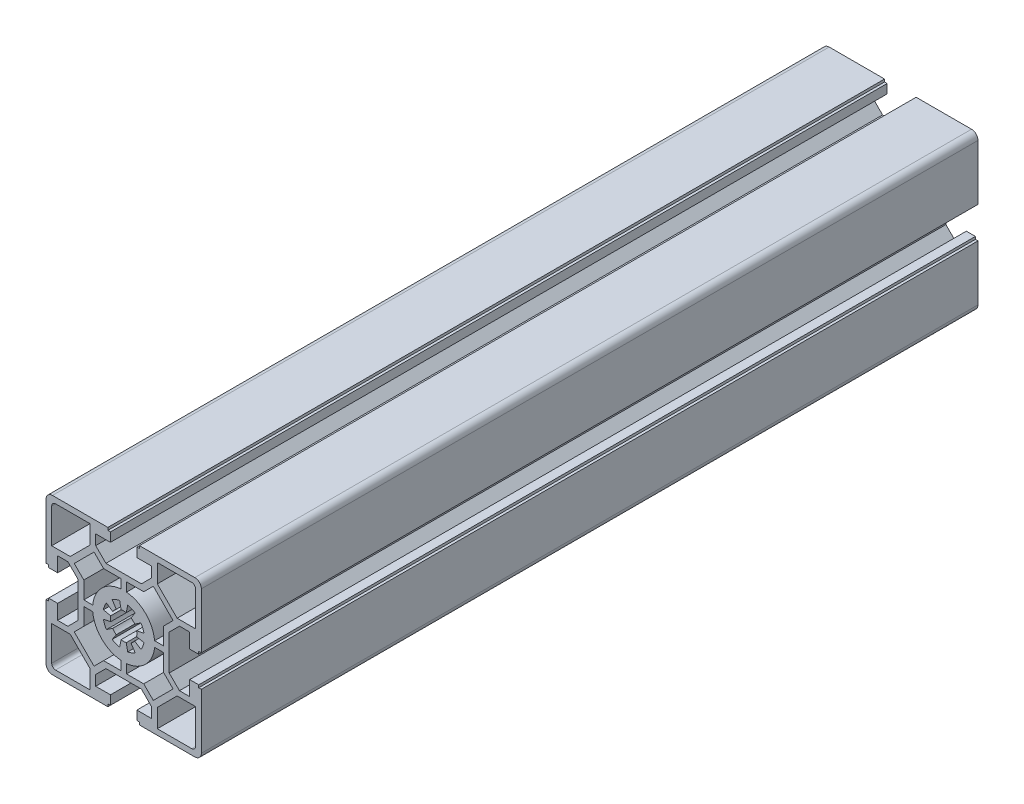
from build123d import *

# Parameters (mm, degrees)
EXTRUDE_1_DEPTH = 150


with BuildPart() as part:
    # Sketch 1 → Extrude 1 (new, symmetric)
    with BuildSketch(Plane.XY):
        with BuildLine():
            Line((-6.850000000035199, 17.60000000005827), (-10.800000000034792, 21.550000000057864))
            Line((-10.800000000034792, 21.550000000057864), (-10.800000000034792, 25.500000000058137))
            Line((-10.800000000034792, 25.500000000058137), (-5.100000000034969, 25.500000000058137))
            Line((-5.100000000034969, 25.500000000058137), (-5.100000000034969, 29.00000000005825))
            Line((-5.100000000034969, 29.00000000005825), (-6.1000000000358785, 29.00000000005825))
            Line((-6.1000000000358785, 29.00000000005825), (-6.1000000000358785, 30.00000000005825))
            Line((-6.1000000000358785, 30.00000000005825), (-27.500000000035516, 30.00000000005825))
            ThreePointArc((-27.500000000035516, 30.00000000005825), (-29.267766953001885, 29.26776695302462), (-30.000000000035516, 27.50000000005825))
            Line((-30.000000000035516, 27.50000000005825), (-30.000000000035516, 6.100000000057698))
            Line((-30.000000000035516, 6.100000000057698), (-29.000000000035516, 6.100000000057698))
            Line((-29.000000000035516, 6.100000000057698), (-29.000000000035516, 5.100000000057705))
            Line((-29.000000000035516, 5.100000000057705), (-25.500000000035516, 5.100000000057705))
            Line((-25.500000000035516, 5.100000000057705), (-25.500000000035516, 10.800000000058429))
            Line((-25.500000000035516, 10.800000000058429), (-21.550000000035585, 10.800000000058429))
            Line((-21.550000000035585, 10.800000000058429), (-17.600000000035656, 6.850000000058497))
            Line((-17.600000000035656, 6.850000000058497), (-17.600000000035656, 5.904305e-11))
            Line((-17.600000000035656, 5.904305e-11), (-17.600000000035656, -6.849999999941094))
            Line((-17.600000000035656, -6.849999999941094), (-21.550000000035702, -10.799999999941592))
            Line((-21.550000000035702, -10.799999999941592), (-25.50000000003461, -10.799999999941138))
            Line((-25.50000000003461, -10.799999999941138), (-25.50000000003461, -5.099999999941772))
            Line((-25.50000000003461, -5.099999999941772), (-29.00000000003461, -5.099999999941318))
            Line((-29.00000000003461, -5.099999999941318), (-29.00000000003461, -6.099999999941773))
            Line((-29.00000000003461, -6.099999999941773), (-30.00000000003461, -6.099999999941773))
            Line((-30.00000000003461, -6.099999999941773), (-30.00000000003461, -27.49999999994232))
            ThreePointArc((-30.00000000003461, -27.49999999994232), (-29.26776695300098, -29.26776695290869), (-27.50000000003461, -29.999999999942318))
            Line((-27.50000000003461, -29.999999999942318), (-6.1000000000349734, -29.999999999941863))
            Line((-6.1000000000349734, -29.999999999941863), (-6.1000000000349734, -28.999999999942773))
            Line((-6.1000000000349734, -28.999999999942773), (-5.100000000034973, -28.999999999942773))
            Line((-5.100000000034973, -28.999999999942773), (-5.100000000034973, -25.499999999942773))
            Line((-5.100000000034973, -25.499999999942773), (-10.800000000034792, -25.499999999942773))
            Line((-10.800000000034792, -25.499999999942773), (-10.800000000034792, -21.549999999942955))
            Line((-10.800000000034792, -21.549999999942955), (-6.850000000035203, -17.599999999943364))
            Line((-6.850000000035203, -17.599999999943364), (-3.484019e-11, -17.599999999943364))
            Line((-3.484019e-11, -17.599999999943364), (6.849999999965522, -17.599999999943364))
            Line((6.849999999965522, -17.599999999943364), (10.799999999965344, -21.549999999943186))
            Line((10.799999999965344, -21.549999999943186), (10.799999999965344, -25.499999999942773))
            Line((10.799999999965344, -25.499999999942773), (5.0999999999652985, -25.499999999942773))
            Line((5.0999999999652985, -25.499999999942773), (5.0999999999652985, -28.999999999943))
            Line((5.0999999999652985, -28.999999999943), (6.099999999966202, -28.999999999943))
            Line((6.099999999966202, -28.999999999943), (6.099999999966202, -29.999999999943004))
            Line((6.099999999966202, -29.999999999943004), (27.499999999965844, -29.999999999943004))
            ThreePointArc((27.499999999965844, -29.999999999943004), (29.267766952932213, -29.267766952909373), (29.999999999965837, -27.499999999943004))
            Line((29.999999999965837, -27.499999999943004), (29.999999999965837, -6.099999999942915))
            Line((29.999999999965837, -6.099999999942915), (28.999999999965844, -6.099999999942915))
            Line((28.999999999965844, -6.099999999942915), (28.999999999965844, -5.099999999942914))
            Line((28.999999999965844, -5.099999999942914), (25.49999999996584, -5.099999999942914))
            Line((25.49999999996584, -5.099999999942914), (25.49999999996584, -10.79999999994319))
            Line((25.49999999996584, -10.79999999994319), (21.549999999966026, -10.79999999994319))
            Line((21.549999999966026, -10.79999999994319), (17.599999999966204, -6.84999999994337))
            Line((17.599999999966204, -6.84999999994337), (17.599999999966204, 5.654158e-11))
            Line((17.599999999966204, 5.654158e-11), (17.599999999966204, 6.850000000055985))
            Line((17.599999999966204, 6.850000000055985), (21.549999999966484, 10.800000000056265))
            Line((21.549999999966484, 10.800000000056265), (25.4999999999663, 10.800000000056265))
            Line((25.4999999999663, 10.800000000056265), (25.4999999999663, 5.100000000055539))
            Line((25.4999999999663, 5.100000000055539), (28.999999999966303, 5.100000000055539))
            Line((28.999999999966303, 5.100000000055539), (28.999999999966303, 6.100000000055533))
            Line((28.999999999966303, 6.100000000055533), (29.99999999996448, 6.100000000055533))
            Line((29.99999999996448, 6.100000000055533), (29.99999999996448, 27.500000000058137))
            ThreePointArc((29.99999999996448, 27.500000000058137), (29.26776695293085, 29.267766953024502), (27.499999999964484, 30.00000000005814))
            Line((27.499999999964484, 30.00000000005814), (6.0999999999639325, 30.00000000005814))
            Line((6.0999999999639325, 30.00000000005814), (6.0999999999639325, 29.00000000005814))
            Line((6.0999999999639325, 29.00000000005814), (5.099999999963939, 29.00000000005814))
            Line((5.099999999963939, 29.00000000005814), (5.099999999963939, 25.500000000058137))
            Line((5.099999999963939, 25.500000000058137), (10.799999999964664, 25.500000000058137))
            Line((10.799999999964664, 25.500000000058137), (10.799999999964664, 21.550000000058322))
            Line((10.799999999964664, 21.550000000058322), (6.849999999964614, 17.60000000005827))
            Line((6.849999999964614, 17.60000000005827), (-3.483672e-11, 17.60000000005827))
            Line((-3.483672e-11, 17.60000000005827), (-6.850000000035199, 17.60000000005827))
        make_face()
        with BuildLine():
            Line((-4.24049502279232, 2.8334081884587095), (-6.651756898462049, 4.444561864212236))
            ThreePointArc((-6.651756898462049, 4.444561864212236), (-7.391036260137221, 3.061467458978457), (-7.846282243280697, 1.5607225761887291))
            Line((-7.846282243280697, 1.5607225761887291), (-5.0020049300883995, 0.9949606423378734))
            ThreePointArc((-5.0020049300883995, 0.9949606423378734), (-5.075442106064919, 0.499887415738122), (-5.1000000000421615, 5.865447e-11))
            ThreePointArc((-5.1000000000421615, 5.865447e-11), (-5.075442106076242, -0.4998874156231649), (-5.002004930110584, -0.9949606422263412))
            Line((-5.002004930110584, -0.9949606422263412), (-7.846282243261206, -1.560722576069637))
            ThreePointArc((-7.846282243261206, -1.560722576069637), (-7.391036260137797, -3.06146745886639), (-6.651756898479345, -4.444561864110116))
            Line((-6.651756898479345, -4.444561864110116), (-4.240495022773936, -2.833408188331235))
            ThreePointArc((-4.240495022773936, -2.833408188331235), (-3.9423533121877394, -3.235405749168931), (-3.60624458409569, -3.6062445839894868))
            ThreePointArc((-3.60624458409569, -3.6062445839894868), (-3.235405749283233, -3.9423533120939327), (-2.8334081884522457, -4.24049502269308))
            Line((-2.8334081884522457, -4.24049502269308), (-4.44456186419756, -6.651756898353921))
            ThreePointArc((-4.44456186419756, -6.651756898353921), (-3.061467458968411, -7.391036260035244), (-1.5607225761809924, -7.846282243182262))
            Line((-1.5607225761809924, -7.846282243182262), (-0.9949606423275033, -5.00200492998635))
            ThreePointArc((-0.9949606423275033, -5.00200492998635), (-0.4998874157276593, -5.075442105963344), (-4.800327e-11, -5.099999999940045))
            ThreePointArc((-4.800327e-11, -5.099999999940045), (0.49988741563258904, -5.075442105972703), (0.9949606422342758, -5.00200493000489))
            Line((0.9949606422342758, -5.00200493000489), (1.5607225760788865, -7.846282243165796))
            ThreePointArc((1.5607225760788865, -7.846282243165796), (3.06146745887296, -7.391036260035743), (4.44456186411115, -6.651756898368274))
            Line((4.44456186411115, -6.651756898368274), (2.8334081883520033, -4.240495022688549))
            ThreePointArc((2.8334081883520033, -4.240495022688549), (3.235405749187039, -3.9423533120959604), (3.606244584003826, -3.6062445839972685))
            ThreePointArc((3.606244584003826, -3.6062445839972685), (3.942353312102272, -3.235405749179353), (4.240495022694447, -2.833408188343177))
            Line((4.240495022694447, -2.833408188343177), (6.651756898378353, -4.4445618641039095))
            ThreePointArc((6.651756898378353, -4.4445618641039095), (7.391036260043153, -3.0614674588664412), (7.84628224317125, -1.560722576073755))
            Line((7.84628224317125, -1.560722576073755), (5.002004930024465, -0.9949606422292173))
            ThreePointArc((5.002004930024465, -0.9949606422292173), (5.075442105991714, -0.4998874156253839), (5.099999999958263, 5.729098e-11))
            ThreePointArc((5.099999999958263, 5.729098e-11), (5.07544210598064, 0.4998874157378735), (5.002004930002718, 0.9949606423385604))
            Line((5.002004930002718, 0.9949606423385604), (7.846282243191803, 1.5607225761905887))
            ThreePointArc((7.846282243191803, 1.5607225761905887), (7.391036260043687, 3.06146745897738), (6.651756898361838, 4.444561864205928))
            Line((6.651756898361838, 4.444561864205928), (4.240495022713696, 2.8334081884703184))
            ThreePointArc((4.240495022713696, 2.8334081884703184), (3.9423533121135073, 3.2354057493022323), (3.606244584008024, 3.606244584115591))
            ThreePointArc((3.606244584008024, 3.606244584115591), (3.2354057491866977, 3.9423533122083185), (2.833408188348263, 4.2404950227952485))
            Line((2.833408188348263, 4.2404950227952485), (4.444561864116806, 6.651756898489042))
            ThreePointArc((4.444561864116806, 6.651756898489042), (3.0614674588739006, 7.391036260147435), (1.560722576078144, 7.846282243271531))
            Line((1.560722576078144, 7.846282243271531), (0.9949606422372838, 5.00200493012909))
            ThreePointArc((0.9949606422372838, 5.00200493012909), (0.4998874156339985, 5.075442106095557), (-4.800327e-11, 5.100000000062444))
            ThreePointArc((-4.800327e-11, 5.100000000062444), (-0.49988741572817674, 5.07544210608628), (-0.9949606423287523, 5.002004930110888))
            Line((-0.9949606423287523, 5.002004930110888), (-1.5607225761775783, 7.8462822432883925))
            ThreePointArc((-1.5607225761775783, 7.8462822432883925), (-3.0614674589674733, 7.391036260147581), (-4.444561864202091, 6.651756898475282))
            Line((-4.444561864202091, 6.651756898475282), (-2.8334081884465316, 4.240495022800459))
            ThreePointArc((-2.8334081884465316, 4.240495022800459), (-3.2354057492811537, 3.9423533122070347), (-3.6062445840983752, 3.6062445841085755))
            ThreePointArc((-3.6062445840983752, 3.6062445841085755), (-3.942353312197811, 3.235405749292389), (-4.24049502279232, 2.8334081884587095))
        make_face(mode=Mode.SUBTRACT)
        with BuildLine():
            Line((11.444365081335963, -19.09452808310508), (15.269446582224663, -15.269446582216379))
            Line((15.269446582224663, -15.269446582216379), (19.094528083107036, -11.444365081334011))
            Line((19.094528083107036, -11.444365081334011), (15.399999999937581, -7.749836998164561))
            Line((15.399999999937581, -7.749836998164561), (15.399999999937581, -1.0999999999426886))
            Line((15.399999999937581, -1.0999999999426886), (11.949476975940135, -1.0999999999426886))
            ThreePointArc((11.949476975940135, -1.0999999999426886), (10.864181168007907, -5.096034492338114), (8.48528137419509, -8.485281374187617))
            ThreePointArc((8.48528137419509, -8.485281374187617), (5.096034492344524, -10.864181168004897), (1.0999999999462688, -11.949476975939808))
            Line((1.0999999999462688, -11.949476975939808), (1.0999999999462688, -15.399999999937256))
            Line((1.0999999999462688, -15.399999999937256), (7.749836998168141, -15.399999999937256))
            Line((7.749836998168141, -15.399999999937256), (11.444365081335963, -19.09452808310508))
        make_face(mode=Mode.SUBTRACT)
        with BuildLine():
            Line((-15.26944658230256, -15.269446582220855), (-11.444365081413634, -19.094528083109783))
            Line((-11.444365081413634, -19.094528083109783), (-7.74983699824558, -15.39999999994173))
            Line((-7.74983699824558, -15.39999999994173), (-1.100000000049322, -15.39999999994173))
            Line((-1.100000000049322, -15.39999999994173), (-1.100000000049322, -11.949476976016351))
            ThreePointArc((-1.100000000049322, -11.949476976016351), (-5.096034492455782, -10.864181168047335), (-8.485281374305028, -8.485281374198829))
            ThreePointArc((-8.485281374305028, -8.485281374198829), (-10.86418116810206, -5.096034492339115), (-11.949476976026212, -1.0999999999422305))
            Line((-11.949476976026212, -1.0999999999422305), (-15.400000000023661, -1.0999999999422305))
            Line((-15.400000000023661, -1.0999999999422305), (-15.400000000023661, -7.749836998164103))
            Line((-15.400000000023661, -7.749836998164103), (-19.094528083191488, -11.444365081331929))
            Line((-19.094528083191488, -11.444365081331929), (-15.26944658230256, -15.269446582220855))
        make_face(mode=Mode.SUBTRACT)
        with BuildLine():
            Line((15.269446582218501, 15.269446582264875), (11.444365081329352, 19.094528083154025))
            Line((11.444365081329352, 19.094528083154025), (7.749836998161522, 15.399999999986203))
            Line((7.749836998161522, 15.399999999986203), (1.0999999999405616, 15.399999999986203))
            Line((1.0999999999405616, 15.399999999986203), (1.0999999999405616, 11.949476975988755))
            ThreePointArc((1.0999999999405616, 11.949476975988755), (5.096034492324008, 10.864181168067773), (8.485281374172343, 8.485281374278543))
            ThreePointArc((8.485281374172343, 8.485281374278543), (10.864181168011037, 5.0960344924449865), (11.949476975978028, 1.1000000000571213))
            Line((11.949476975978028, 1.1000000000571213), (15.399999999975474, 1.1000000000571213))
            Line((15.399999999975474, 1.1000000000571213), (15.399999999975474, 7.74983699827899))
            Line((15.399999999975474, 7.74983699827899), (19.09452808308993, 11.444365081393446))
            Line((19.09452808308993, 11.444365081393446), (15.269446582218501, 15.269446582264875))
        make_face(mode=Mode.SUBTRACT)
        with BuildLine():
            Line((-7.749836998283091, 15.400000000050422), (-11.44436508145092, 19.09452808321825))
            Line((-11.44436508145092, 19.09452808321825), (-15.269446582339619, 15.269446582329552))
            Line((-15.269446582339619, 15.269446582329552), (-19.094528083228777, 11.444365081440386))
            Line((-19.094528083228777, 11.444365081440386), (-15.400000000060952, 7.749836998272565))
            Line((-15.400000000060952, 7.749836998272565), (-15.400000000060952, 1.1000000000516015))
            Line((-15.400000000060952, 1.1000000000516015), (-11.949476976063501, 1.1000000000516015))
            ThreePointArc((-11.949476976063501, 1.1000000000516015), (-10.864181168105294, 5.096034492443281), (-8.485281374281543, 8.485281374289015))
            ThreePointArc((-8.485281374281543, 8.485281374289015), (-5.096034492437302, 10.864181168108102), (-1.100000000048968, 11.949476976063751))
            Line((-1.100000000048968, 11.949476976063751), (-1.100000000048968, 15.400000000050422))
            Line((-1.100000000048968, 15.400000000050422), (-7.749836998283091, 15.400000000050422))
        make_face(mode=Mode.SUBTRACT)
        with BuildLine():
            Line((27.799999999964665, -26.299999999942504), (27.799999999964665, -12.999999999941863))
            Line((27.799999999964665, -12.999999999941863), (20.650163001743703, -12.999999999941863))
            Line((20.650163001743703, -12.999999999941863), (16.825081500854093, -16.825081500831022))
            Line((16.825081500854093, -16.825081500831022), (12.999999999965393, -20.650163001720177))
            Line((12.999999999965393, -20.650163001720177), (12.999999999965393, -27.79999999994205))
            Line((12.999999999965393, -27.79999999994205), (26.299999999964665, -27.799999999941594))
            ThreePointArc((26.299999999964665, -27.799999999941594), (27.36066017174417, -27.36066017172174), (27.799999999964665, -26.299999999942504))
        make_face(mode=Mode.SUBTRACT)
        with BuildLine():
            Line((-26.300000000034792, -27.799999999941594), (-13.000000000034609, -27.799999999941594))
            Line((-13.000000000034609, -27.799999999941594), (-13.000000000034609, -20.650163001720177))
            Line((-13.000000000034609, -20.650163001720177), (-16.825081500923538, -16.825081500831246))
            Line((-16.825081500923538, -16.825081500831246), (-20.65016300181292, -12.999999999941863))
            Line((-20.65016300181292, -12.999999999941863), (-27.800000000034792, -12.999999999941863))
            Line((-27.800000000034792, -12.999999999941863), (-27.800000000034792, -26.29999999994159))
            ThreePointArc((-27.800000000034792, -26.29999999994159), (-27.360660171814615, -27.360660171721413), (-26.300000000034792, -27.799999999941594))
        make_face(mode=Mode.SUBTRACT)
        with BuildLine():
            Line((12.999999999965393, 20.650163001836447), (16.825081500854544, 16.825081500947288))
            Line((16.825081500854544, 16.825081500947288), (20.650163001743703, 13.000000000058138))
            Line((20.650163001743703, 13.000000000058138), (27.799999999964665, 13.000000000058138))
            Line((27.799999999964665, 13.000000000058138), (27.799999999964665, 26.300000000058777))
            ThreePointArc((27.799999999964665, 26.300000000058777), (27.360660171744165, 27.360660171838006), (26.299999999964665, 27.80000000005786))
            Line((26.299999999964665, 27.80000000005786), (12.999999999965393, 27.80000000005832))
            Line((12.999999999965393, 27.80000000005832), (12.999999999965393, 20.650163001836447))
        make_face(mode=Mode.SUBTRACT)
        with BuildLine():
            Line((-27.800000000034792, 26.30000000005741), (-27.800000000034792, 13.000000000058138))
            Line((-27.800000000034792, 13.000000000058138), (-20.65016300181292, 13.000000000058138))
            Line((-20.65016300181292, 13.000000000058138), (-16.825081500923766, 16.825081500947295))
            Line((-16.825081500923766, 16.825081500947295), (-13.000000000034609, 20.650163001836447))
            Line((-13.000000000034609, 20.650163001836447), (-13.000000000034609, 27.80000000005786))
            Line((-13.000000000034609, 27.80000000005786), (-26.300000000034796, 27.80000000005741))
            ThreePointArc((-26.300000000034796, 27.80000000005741), (-27.360660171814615, 27.36066017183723), (-27.800000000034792, 26.30000000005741))
        make_face(mode=Mode.SUBTRACT)
    extrude(amount=EXTRUDE_1_DEPTH, both=True)


solid = part.part
